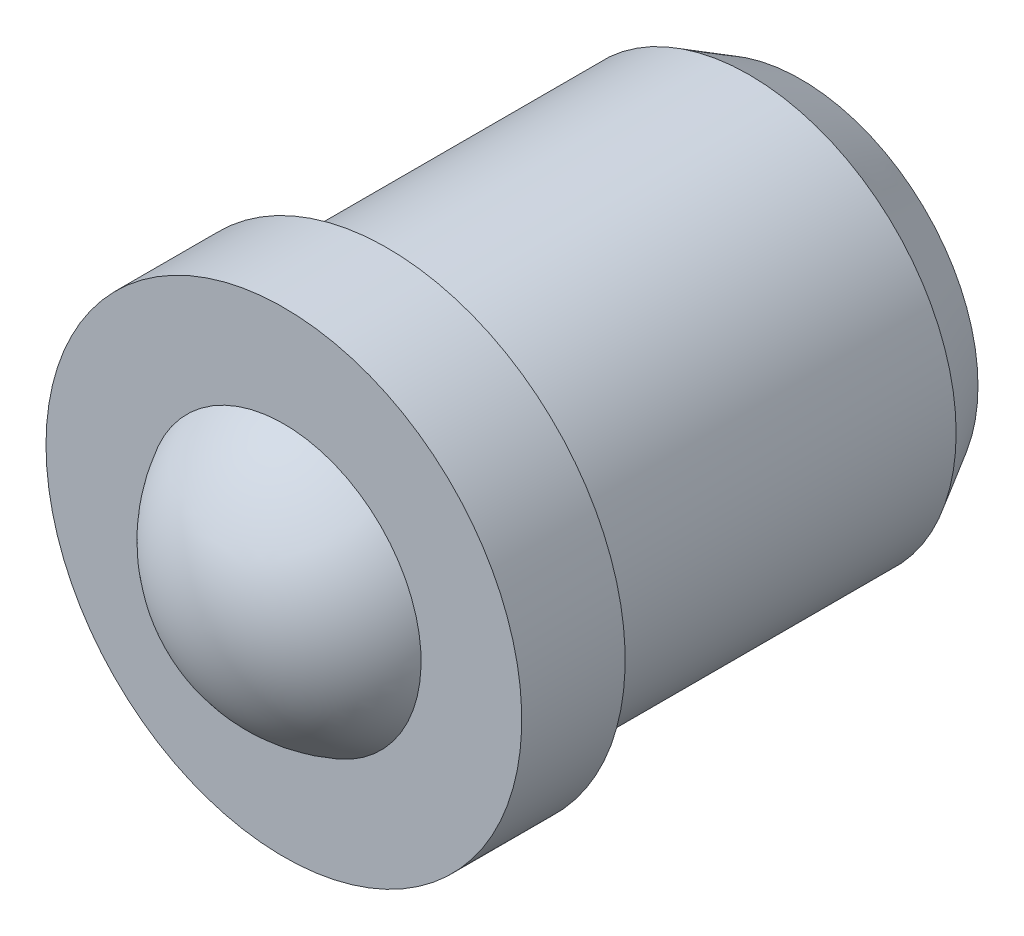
ISO-10303-21;
HEADER;
FILE_DESCRIPTION(('STEP AP214'),'2;1');
FILE_NAME('part.step','',(''),(''),'','','');
FILE_SCHEMA(('AUTOMOTIVE_DESIGN { 1 0 10303 214 1 1 1 1 }'));
ENDSEC;
DATA;
#1=APPLICATION_CONTEXT('core data for automotive mechanical design processes');
#2=APPLICATION_PROTOCOL_DEFINITION('international standard','automotive_design',2000,#1);
#3=PRODUCT_CONTEXT('',#1,'mechanical');
#4=PRODUCT('Part','Part','',(#3));
#5=PRODUCT_RELATED_PRODUCT_CATEGORY('part','',(#4));
#6=PRODUCT_DEFINITION_FORMATION('','',#4);
#7=PRODUCT_DEFINITION_CONTEXT('part definition',#1,'design');
#8=PRODUCT_DEFINITION('design','',#6,#7);
#9=PRODUCT_DEFINITION_SHAPE('','',#8);
#10=(LENGTH_UNIT() NAMED_UNIT(*) SI_UNIT(.MILLI.,.METRE.));
#11=(NAMED_UNIT(*) PLANE_ANGLE_UNIT() SI_UNIT($,.RADIAN.));
#12=(NAMED_UNIT(*) SI_UNIT($,.STERADIAN.) SOLID_ANGLE_UNIT());
#13=UNCERTAINTY_MEASURE_WITH_UNIT(LENGTH_MEASURE(1.E-05),#10,'distance_accuracy_value','');
#14=(GEOMETRIC_REPRESENTATION_CONTEXT(3) GLOBAL_UNCERTAINTY_ASSIGNED_CONTEXT((#13)) GLOBAL_UNIT_ASSIGNED_CONTEXT((#10,
#11,#12)) REPRESENTATION_CONTEXT('',''));
#15=CARTESIAN_POINT('',(0.,0.,0.));
#16=DIRECTION('',(0.,0.,1.));
#17=DIRECTION('',(1.,0.,0.));
#18=AXIS2_PLACEMENT_3D('',#15,#16,#17);
#19=CARTESIAN_POINT('',(0.,0.,0.300000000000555));
#20=DIRECTION('',(0.,0.,-1.));
#21=DIRECTION('',(0.,-1.,0.));
#22=AXIS2_PLACEMENT_3D('',#19,#20,#21);
#23=SPHERICAL_SURFACE('',#22,1.5);
#24=CARTESIAN_POINT('',(0.,0.,1.));
#25=DIRECTION('',(0.,0.,-1.));
#26=DIRECTION('',(-1.,0.,0.));
#27=AXIS2_PLACEMENT_3D('',#24,#25,#26);
#28=CIRCLE('',#27,1.32664991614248);
#29=CARTESIAN_POINT('',(-1.32664991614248,0.,1.));
#30=VERTEX_POINT('',#29);
#31=EDGE_CURVE('E23',#30,#30,#28,.T.);
#32=ORIENTED_EDGE('',*,*,#31,.F.);
#33=EDGE_LOOP('',(#32));
#34=FACE_BOUND('',#33,.T.);
#35=ADVANCED_FACE('F12',(#34),#23,.T.);
#36=CARTESIAN_POINT('',(0.,-2.30000000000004,1.));
#37=DIRECTION('',(0.,0.,-1.));
#38=DIRECTION('',(-1.,0.,0.));
#39=AXIS2_PLACEMENT_3D('',#36,#37,#38);
#40=PLANE('',#39);
#41=CARTESIAN_POINT('',(0.,0.,1.));
#42=DIRECTION('',(0.,0.,-1.));
#43=DIRECTION('',(-1.,0.,0.));
#44=AXIS2_PLACEMENT_3D('',#41,#42,#43);
#45=CIRCLE('',#44,2.30000000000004);
#46=CARTESIAN_POINT('',(-2.30000000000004,0.,1.));
#47=VERTEX_POINT('',#46);
#48=EDGE_CURVE('E27',#47,#47,#45,.T.);
#49=ORIENTED_EDGE('',*,*,#48,.F.);
#50=EDGE_LOOP('',(#49));
#51=FACE_BOUND('',#50,.T.);
#52=ORIENTED_EDGE('',*,*,#31,.T.);
#53=EDGE_LOOP('',(#52));
#54=FACE_BOUND('',#53,.T.);
#55=ADVANCED_FACE('F50',(#51,#54),#40,.F.);
#56=CARTESIAN_POINT('',(0.,0.,-3.99999983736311));
#57=DIRECTION('',(0.,0.,-1.));
#58=DIRECTION('',(-1.,0.,0.));
#59=AXIS2_PLACEMENT_3D('',#56,#57,#58);
#60=CYLINDRICAL_SURFACE('',#59,2.30000000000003);
#61=CARTESIAN_POINT('',(0.,0.,0.));
#62=DIRECTION('',(0.,0.,-1.));
#63=DIRECTION('',(-1.,0.,0.));
#64=AXIS2_PLACEMENT_3D('',#61,#62,#63);
#65=CIRCLE('',#64,2.30000000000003);
#66=CARTESIAN_POINT('',(-2.30000000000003,0.,0.));
#67=VERTEX_POINT('',#66);
#68=EDGE_CURVE('E32',#67,#67,#65,.T.);
#69=ORIENTED_EDGE('',*,*,#68,.F.);
#70=EDGE_LOOP('',(#69));
#71=FACE_BOUND('',#70,.T.);
#72=ORIENTED_EDGE('',*,*,#48,.T.);
#73=EDGE_LOOP('',(#72));
#74=FACE_BOUND('',#73,.T.);
#75=ADVANCED_FACE('F44',(#71,#74),#60,.T.);
#76=CARTESIAN_POINT('',(0.,-2.30000000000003,0.));
#77=DIRECTION('',(0.,0.,1.));
#78=DIRECTION('',(1.,0.,0.));
#79=AXIS2_PLACEMENT_3D('',#76,#77,#78);
#80=PLANE('',#79);
#81=CARTESIAN_POINT('',(0.,0.,0.));
#82=DIRECTION('',(0.,0.,-1.));
#83=DIRECTION('',(-1.,0.,0.));
#84=AXIS2_PLACEMENT_3D('',#81,#82,#83);
#85=CIRCLE('',#84,2.00000000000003);
#86=CARTESIAN_POINT('',(-2.00000000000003,0.,0.));
#87=VERTEX_POINT('',#86);
#88=EDGE_CURVE('E35',#87,#87,#85,.T.);
#89=ORIENTED_EDGE('',*,*,#88,.F.);
#90=EDGE_LOOP('',(#89));
#91=FACE_BOUND('',#90,.T.);
#92=ORIENTED_EDGE('',*,*,#68,.T.);
#93=EDGE_LOOP('',(#92));
#94=FACE_BOUND('',#93,.T.);
#95=ADVANCED_FACE('F41',(#91,#94),#80,.F.);
#96=CARTESIAN_POINT('',(0.,0.,-3.99999983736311));
#97=DIRECTION('',(0.,0.,-1.));
#98=DIRECTION('',(-1.,0.,0.));
#99=AXIS2_PLACEMENT_3D('',#96,#97,#98);
#100=CYLINDRICAL_SURFACE('',#99,2.);
#101=CARTESIAN_POINT('',(0.,0.,-3.49999983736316));
#102=DIRECTION('',(0.,0.,1.));
#103=DIRECTION('',(1.,0.,0.));
#104=AXIS2_PLACEMENT_3D('',#101,#102,#103);
#105=CIRCLE('',#104,2.);
#106=CARTESIAN_POINT('',(2.,0.,-3.49999983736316));
#107=VERTEX_POINT('',#106);
#108=EDGE_CURVE('E19',#107,#107,#105,.T.);
#109=ORIENTED_EDGE('',*,*,#108,.T.);
#110=EDGE_LOOP('',(#109));
#111=FACE_BOUND('',#110,.T.);
#112=ORIENTED_EDGE('',*,*,#88,.T.);
#113=EDGE_LOOP('',(#112));
#114=FACE_BOUND('',#113,.T.);
#115=ADVANCED_FACE('F39',(#111,#114),#100,.T.);
#116=CARTESIAN_POINT('',(0.,-1.24999999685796,-3.99999983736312));
#117=DIRECTION('',(0.,0.,1.));
#118=DIRECTION('',(1.,0.,0.));
#119=AXIS2_PLACEMENT_3D('',#116,#117,#118);
#120=PLANE('',#119);
#121=CARTESIAN_POINT('',(0.,0.,-3.99999983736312));
#122=DIRECTION('',(0.,0.,1.));
#123=DIRECTION('',(1.,0.,0.));
#124=AXIS2_PLACEMENT_3D('',#121,#122,#123);
#125=CIRCLE('',#124,1.71132486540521);
#126=CARTESIAN_POINT('',(1.71132486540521,0.,-3.99999983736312));
#127=VERTEX_POINT('',#126);
#128=EDGE_CURVE('E8',#127,#127,#125,.F.);
#129=ORIENTED_EDGE('',*,*,#128,.T.);
#130=EDGE_LOOP('',(#129));
#131=FACE_BOUND('',#130,.T.);
#132=ADVANCED_FACE('F67',(#131),#120,.F.);
#133=CARTESIAN_POINT('',(0.,0.,-3.49999983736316));
#134=DIRECTION('',(0.,0.,1.));
#135=DIRECTION('',(1.,0.,0.));
#136=AXIS2_PLACEMENT_3D('',#133,#134,#135);
#137=CONICAL_SURFACE('',#136,2.,0.523598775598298);
#138=ORIENTED_EDGE('',*,*,#128,.F.);
#139=EDGE_LOOP('',(#138));
#140=FACE_BOUND('',#139,.T.);
#141=ORIENTED_EDGE('',*,*,#108,.F.);
#142=EDGE_LOOP('',(#141));
#143=FACE_BOUND('',#142,.T.);
#144=ADVANCED_FACE('F14',(#140,#143),#137,.T.);
#145=CLOSED_SHELL('',(#35,#55,#75,#95,#115,#132,#144));
#146=MANIFOLD_SOLID_BREP('B1',#145);
#147=ADVANCED_BREP_SHAPE_REPRESENTATION('',(#18,#146),#14);
#148=SHAPE_DEFINITION_REPRESENTATION(#9,#147);
ENDSEC;
END-ISO-10303-21;
